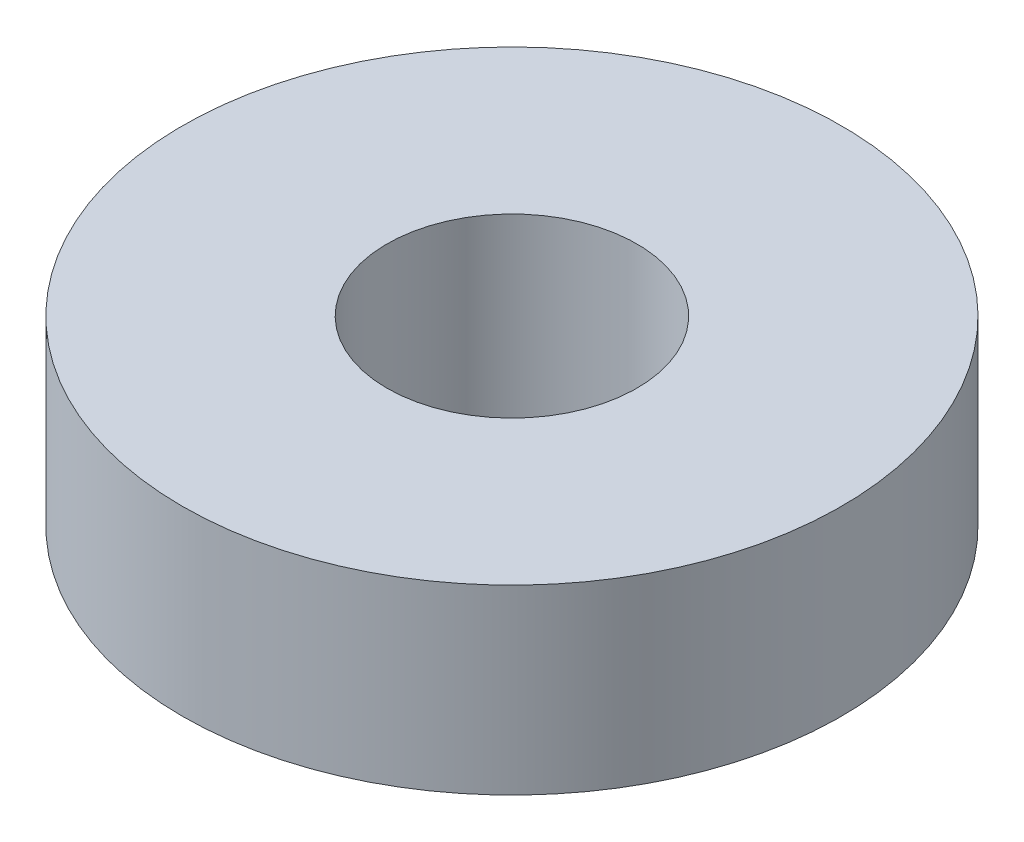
from build123d import *

# Parameters (mm, degrees)
SKETCH1_R           = 9.2075
SKETCH1_R_2         = 3.4925
BOSS_EXTRUDE1_DEPTH = 5.08


with BuildPart() as part:
    # Sketch1 → Boss-Extrude1 (new body)
    with BuildSketch(Plane(origin=(0, 0, 0), x_dir=(1, 0, 0), z_dir=(0, 1, 0))):
        with Locations(Location((0, 0, 0), (0, 0, 270))):
            Circle(SKETCH1_R)
        with Locations(Location((0, 0, 0), (0, 0, 270))):
            Circle(SKETCH1_R_2, mode=Mode.SUBTRACT)
    extrude(amount=BOSS_EXTRUDE1_DEPTH)


solid = part.part
